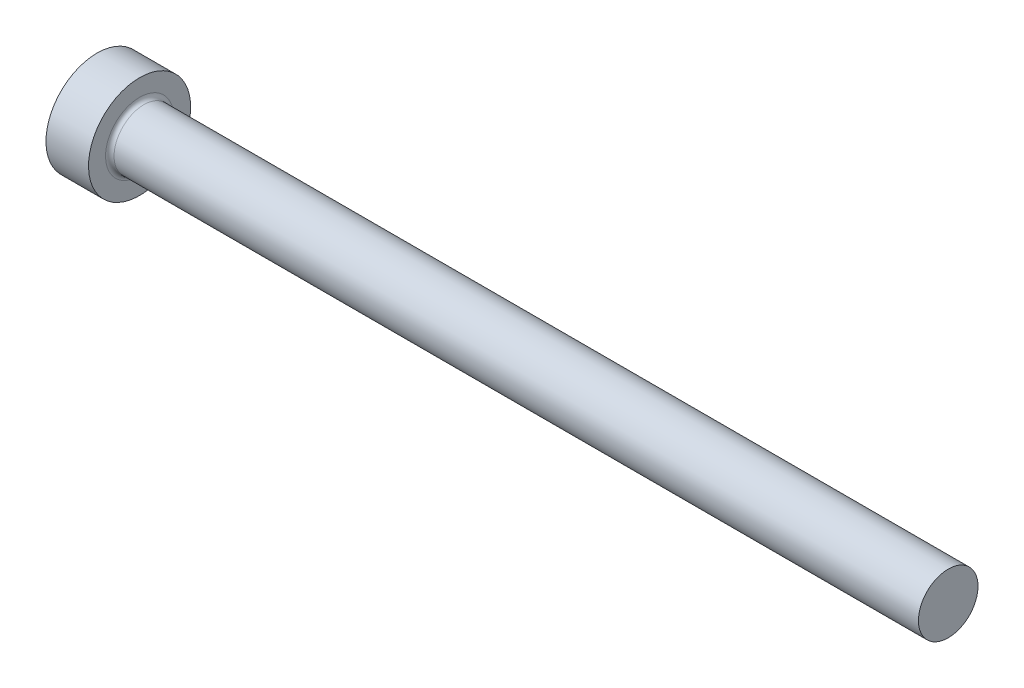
ISO-10303-21;
HEADER;
FILE_DESCRIPTION(('STEP AP214'),'2;1');
FILE_NAME('part.step','',(''),(''),'','','');
FILE_SCHEMA(('AUTOMOTIVE_DESIGN { 1 0 10303 214 1 1 1 1 }'));
ENDSEC;
DATA;
#1=APPLICATION_CONTEXT('core data for automotive mechanical design processes');
#2=APPLICATION_PROTOCOL_DEFINITION('international standard','automotive_design',2000,#1);
#3=PRODUCT_CONTEXT('',#1,'mechanical');
#4=PRODUCT('Part','Part','',(#3));
#5=PRODUCT_RELATED_PRODUCT_CATEGORY('part','',(#4));
#6=PRODUCT_DEFINITION_FORMATION('','',#4);
#7=PRODUCT_DEFINITION_CONTEXT('part definition',#1,'design');
#8=PRODUCT_DEFINITION('design','',#6,#7);
#9=PRODUCT_DEFINITION_SHAPE('','',#8);
#10=(LENGTH_UNIT() NAMED_UNIT(*) SI_UNIT(.MILLI.,.METRE.));
#11=(NAMED_UNIT(*) PLANE_ANGLE_UNIT() SI_UNIT($,.RADIAN.));
#12=(NAMED_UNIT(*) SI_UNIT($,.STERADIAN.) SOLID_ANGLE_UNIT());
#13=UNCERTAINTY_MEASURE_WITH_UNIT(LENGTH_MEASURE(1.E-05),#10,'distance_accuracy_value','');
#14=(GEOMETRIC_REPRESENTATION_CONTEXT(3) GLOBAL_UNCERTAINTY_ASSIGNED_CONTEXT((#13)) GLOBAL_UNIT_ASSIGNED_CONTEXT((#10,
#11,#12)) REPRESENTATION_CONTEXT('',''));
#15=CARTESIAN_POINT('',(0.,0.,0.));
#16=DIRECTION('',(0.,0.,1.));
#17=DIRECTION('',(1.,0.,0.));
#18=AXIS2_PLACEMENT_3D('',#15,#16,#17);
#19=CARTESIAN_POINT('',(0.,0.,0.));
#20=DIRECTION('',(-1.,0.,0.));
#21=DIRECTION('',(0.,-1.,0.));
#22=AXIS2_PLACEMENT_3D('',#19,#20,#21);
#23=PLANE('',#22);
#24=CARTESIAN_POINT('',(0.,0.,0.));
#25=DIRECTION('',(1.,0.,0.));
#26=DIRECTION('',(0.,1.,0.));
#27=AXIS2_PLACEMENT_3D('',#24,#25,#26);
#28=CIRCLE('',#27,6.);
#29=CARTESIAN_POINT('',(0.,6.,0.));
#30=VERTEX_POINT('',#29);
#31=EDGE_CURVE('E25',#30,#30,#28,.T.);
#32=ORIENTED_EDGE('',*,*,#31,.F.);
#33=EDGE_LOOP('',(#32));
#34=FACE_BOUND('',#33,.T.);
#35=ADVANCED_FACE('F14',(#34),#23,.T.);
#36=CARTESIAN_POINT('',(100.,0.,0.));
#37=DIRECTION('',(1.,0.,0.));
#38=DIRECTION('',(0.,1.,0.));
#39=AXIS2_PLACEMENT_3D('',#36,#37,#38);
#40=CYLINDRICAL_SURFACE('',#39,6.);
#41=ORIENTED_EDGE('',*,*,#31,.T.);
#42=EDGE_LOOP('',(#41));
#43=FACE_BOUND('',#42,.T.);
#44=CARTESIAN_POINT('',(5.,0.,0.));
#45=DIRECTION('',(1.,0.,0.));
#46=DIRECTION('',(0.,1.,0.));
#47=AXIS2_PLACEMENT_3D('',#44,#45,#46);
#48=CIRCLE('',#47,6.);
#49=CARTESIAN_POINT('',(5.,6.,0.));
#50=VERTEX_POINT('',#49);
#51=EDGE_CURVE('E29',#50,#50,#48,.T.);
#52=ORIENTED_EDGE('',*,*,#51,.F.);
#53=EDGE_LOOP('',(#52));
#54=FACE_BOUND('',#53,.T.);
#55=ADVANCED_FACE('F51',(#43,#54),#40,.T.);
#56=CARTESIAN_POINT('',(5.,6.,0.));
#57=DIRECTION('',(1.,0.,0.));
#58=DIRECTION('',(0.,1.,0.));
#59=AXIS2_PLACEMENT_3D('',#56,#57,#58);
#60=PLANE('',#59);
#61=CARTESIAN_POINT('',(5.,0.,0.));
#62=DIRECTION('',(1.,0.,0.));
#63=DIRECTION('',(0.,1.,0.));
#64=AXIS2_PLACEMENT_3D('',#61,#62,#63);
#65=CIRCLE('',#64,4.);
#66=CARTESIAN_POINT('',(5.,4.,0.));
#67=VERTEX_POINT('',#66);
#68=EDGE_CURVE('E9',#67,#67,#65,.F.);
#69=ORIENTED_EDGE('',*,*,#68,.T.);
#70=EDGE_LOOP('',(#69));
#71=FACE_BOUND('',#70,.T.);
#72=ORIENTED_EDGE('',*,*,#51,.T.);
#73=EDGE_LOOP('',(#72));
#74=FACE_BOUND('',#73,.T.);
#75=ADVANCED_FACE('F42',(#71,#74),#60,.T.);
#76=CARTESIAN_POINT('',(100.,0.,0.));
#77=DIRECTION('',(1.,0.,0.));
#78=DIRECTION('',(0.,1.,0.));
#79=AXIS2_PLACEMENT_3D('',#76,#77,#78);
#80=CYLINDRICAL_SURFACE('',#79,3.5);
#81=CARTESIAN_POINT('',(5.5,0.,0.));
#82=DIRECTION('',(1.,0.,0.));
#83=DIRECTION('',(0.,1.,0.));
#84=AXIS2_PLACEMENT_3D('',#81,#82,#83);
#85=CIRCLE('',#84,3.5);
#86=CARTESIAN_POINT('',(5.5,3.5,0.));
#87=VERTEX_POINT('',#86);
#88=EDGE_CURVE('E21',#87,#87,#85,.T.);
#89=ORIENTED_EDGE('',*,*,#88,.T.);
#90=EDGE_LOOP('',(#89));
#91=FACE_BOUND('',#90,.T.);
#92=CARTESIAN_POINT('',(100.,0.,0.));
#93=DIRECTION('',(1.,0.,0.));
#94=DIRECTION('',(0.,1.,0.));
#95=AXIS2_PLACEMENT_3D('',#92,#93,#94);
#96=CIRCLE('',#95,3.5);
#97=CARTESIAN_POINT('',(100.,3.49999999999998,0.));
#98=VERTEX_POINT('',#97);
#99=EDGE_CURVE('E34',#98,#98,#96,.T.);
#100=ORIENTED_EDGE('',*,*,#99,.F.);
#101=EDGE_LOOP('',(#100));
#102=FACE_BOUND('',#101,.T.);
#103=ADVANCED_FACE('F40',(#91,#102),#80,.T.);
#104=CARTESIAN_POINT('',(100.,3.5,0.));
#105=DIRECTION('',(1.,0.,0.));
#106=DIRECTION('',(0.,1.,0.));
#107=AXIS2_PLACEMENT_3D('',#104,#105,#106);
#108=PLANE('',#107);
#109=ORIENTED_EDGE('',*,*,#99,.T.);
#110=EDGE_LOOP('',(#109));
#111=FACE_BOUND('',#110,.T.);
#112=ADVANCED_FACE('F38',(#111),#108,.T.);
#113=CARTESIAN_POINT('',(5.5,0.,0.));
#114=DIRECTION('',(1.,0.,0.));
#115=DIRECTION('',(0.,1.,0.));
#116=AXIS2_PLACEMENT_3D('',#113,#114,#115);
#117=TOROIDAL_SURFACE('',#116,4.,0.5);
#118=ORIENTED_EDGE('',*,*,#68,.F.);
#119=EDGE_LOOP('',(#118));
#120=FACE_BOUND('',#119,.T.);
#121=ORIENTED_EDGE('',*,*,#88,.F.);
#122=EDGE_LOOP('',(#121));
#123=FACE_BOUND('',#122,.T.);
#124=ADVANCED_FACE('F16',(#120,#123),#117,.F.);
#125=CLOSED_SHELL('',(#35,#55,#75,#103,#112,#124));
#126=MANIFOLD_SOLID_BREP('B1',#125);
#127=ADVANCED_BREP_SHAPE_REPRESENTATION('',(#18,#126),#14);
#128=SHAPE_DEFINITION_REPRESENTATION(#9,#127);
ENDSEC;
END-ISO-10303-21;
